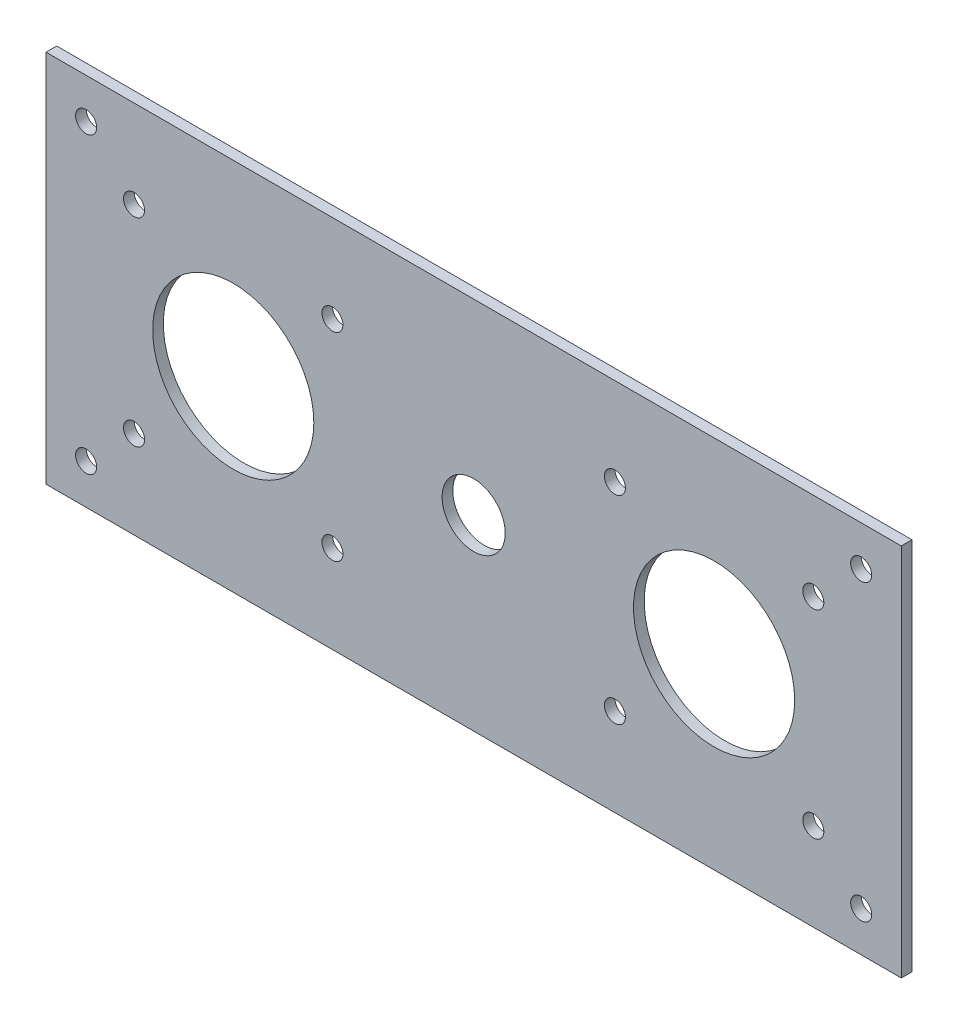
from build123d import *

# Parameters (mm, degrees)
SKETCH2_W               = 203.2
SKETCH2_H               = 88.9
SKETCH2_R               = 2.5
SKETCH2_R_2             = 19.15
BOSS_EXTRUDE1_DEPTH     = 1.27
SKETCH3_R               = 2.5
CUT_EXTRUDE1_DEPTH      = 111.92706658
CUT_EXTRUDE2_DEPTH      = 111.92706658
CUT_EXTRUDE2_DEPTH_BACK = 111.92706658
SKETCH4_R               = 7.5


with BuildPart() as part:
    # Sketch2 → Boss-Extrude1 (new, symmetric)
    with BuildSketch(Plane.XY):
        Rectangle(SKETCH2_W, SKETCH2_H)
        with Locations((-80.695, -23.57)):
            Circle(SKETCH2_R, mode=Mode.SUBTRACT)
        with Locations((-33.555, -23.57)):
            Circle(SKETCH2_R, mode=Mode.SUBTRACT)
        with Locations((-33.555, 23.57)):
            Circle(SKETCH2_R, mode=Mode.SUBTRACT)
        with Locations((-80.695, 23.57)):
            Circle(SKETCH2_R, mode=Mode.SUBTRACT)
        with Locations((33.555, 23.57)):
            Circle(SKETCH2_R, mode=Mode.SUBTRACT)
        with Locations((80.695, 23.57)):
            Circle(SKETCH2_R, mode=Mode.SUBTRACT)
        with Locations((33.555, -23.57)):
            Circle(SKETCH2_R, mode=Mode.SUBTRACT)
        with Locations((80.695, -23.57)):
            Circle(SKETCH2_R, mode=Mode.SUBTRACT)
        with Locations((-57.125, 0)):
            Circle(SKETCH2_R_2, mode=Mode.SUBTRACT)
        with Locations((57.125, 0)):
            Circle(SKETCH2_R_2, mode=Mode.SUBTRACT)
    extrude(amount=BOSS_EXTRUDE1_DEPTH, both=True)

    # Sketch3 → Cut-Extrude1 (cut, through all)
    with BuildSketch(Plane.XY.offset(1.27)):
        with Locations((-92.075, 34.925)):
            Circle(SKETCH3_R)
        with Locations((-92.075, -34.925)):
            Circle(SKETCH3_R)
        with Locations((92.075, -34.925)):
            Circle(SKETCH3_R)
        with Locations((92.075, 34.925)):
            Circle(SKETCH3_R)
    extrude(amount=-CUT_EXTRUDE1_DEPTH, mode=Mode.SUBTRACT)

    # Sketch4 → Cut-Extrude2 (cut, two sides: drawn at the far end of the back side and taken through both)
    with BuildSketch(Plane.XY.offset(1.27).offset(-CUT_EXTRUDE2_DEPTH_BACK)):
        Circle(SKETCH4_R)
    extrude(amount=CUT_EXTRUDE2_DEPTH + CUT_EXTRUDE2_DEPTH_BACK, mode=Mode.SUBTRACT)


solid = part.part
